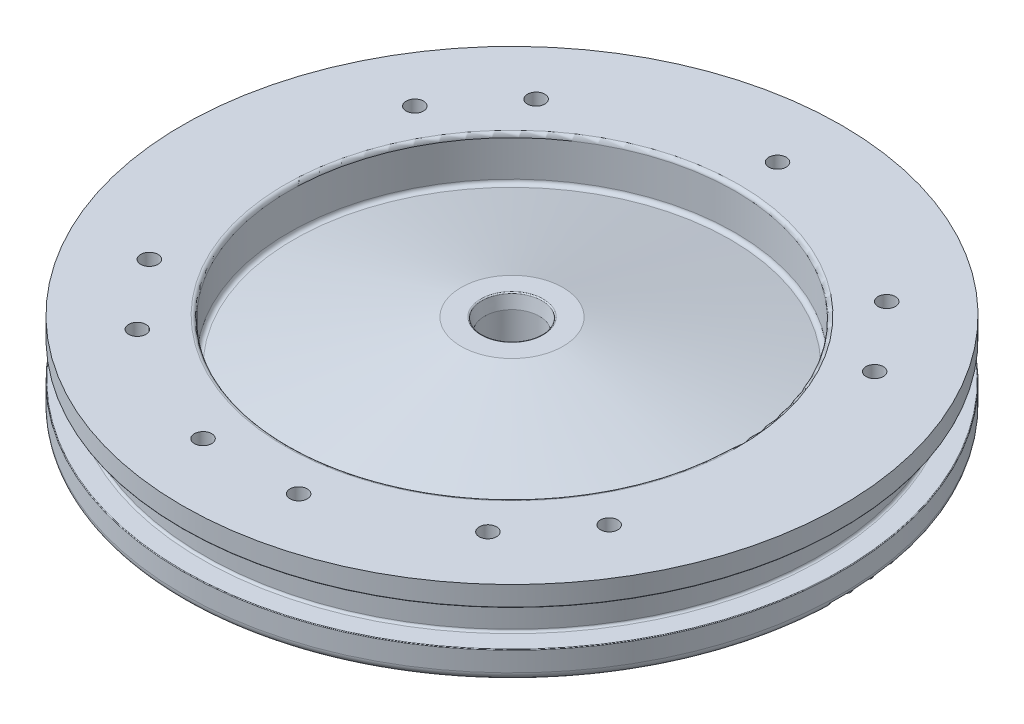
from build123d import *

# Parameters (mm, degrees)
FILLET6_R                 = 0.762
F_8_32_TAPPED_HOLE1_D     = 3.4544
F_8_32_TAPPED_HOLE1_DEPTH = 10.7188
CIRPATTERN1_COUNT         = 6
F_8_32_TAPPED_HOLE2_D     = 3.4544
F_8_32_TAPPED_HOLE2_DEPTH = 10.7188
F_8_32_TAPPED_HOLE2_TIP   = 1.037806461
F_8_32_TAPPED_HOLE3_D     = 3.4544
F_8_32_TAPPED_HOLE3_DEPTH = 10.7188
F_8_32_TAPPED_HOLE3_TIP   = 1.037806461


with BuildPart() as part:
    # Sketch1 → Revolve1 (revolve)
    with BuildSketch(Plane.XY, mode=Mode.PRIVATE) as revolve1_sk:
        with BuildLine():
            Line((-61.7855, -11.22045), (-65.532, -11.22045))
            ThreePointArc((-65.532, -11.22045), (-65.621802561, -11.257647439), (-65.659, -11.34745))
            Line((-65.659, -11.34745), (-65.659, -15.24))
            ThreePointArc((-65.659, -15.24), (-65.194032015, -16.362532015), (-64.0715, -16.8275))
            Line((-64.0715, -16.8275), (-59.309, -16.8275))
            Line((-59.309, -16.8275), (0, -8.89))
            Line((0, -8.89), (0, 0))
            Line((0, 0), (-65.659, 0))
            Line((-65.659, 0), (-65.659, -3.89255))
            ThreePointArc((-65.659, -3.89255), (-65.621802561, -3.982352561), (-65.532, -4.01955))
            Line((-65.532, -4.01955), (-61.7855, -4.01955))
            ThreePointArc((-61.7855, -4.01955), (-61.471191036, -4.149741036), (-61.341, -4.46405))
            Line((-61.341, -4.46405), (-61.341, -10.77595))
            ThreePointArc((-61.341, -10.77595), (-61.471191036, -11.090258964), (-61.7855, -11.22045))
        make_face()
    revolve(revolve1_sk.sketch.rotate(Axis((0, -8.89, 0), (0, 1, 0)), 270), axis=Axis((0, -8.89, 0), (0, 1, 0)))

    # Sketch18 → Cut-Revolve1 (revolve, cut)
    with BuildSketch(Plane.XY, mode=Mode.PRIVATE) as cut_revolve1_sk:
        Polygon((-10.16, 0), (-44.45, 0), (-44.45, -8.89), (-10.16, -0.254), align=None)
    revolve(cut_revolve1_sk.sketch.rotate(Axis((0, 0, 0), (0, -1, 0)), 270), axis=Axis((0, 0, 0), (0, -1, 0)), mode=Mode.SUBTRACT)

    # Fillet6
    fillet6_edges = [part.edges().sort_by_distance(p)[0] for p in [
        (0, -8.89, -44.45),
        (0, 0, -44.45),
    ]]
    fillet(fillet6_edges, radius=FILLET6_R)

    # Port Sketch → SAE Port (revolve, cut)
    with BuildSketch(Plane(origin=(1.90754352, 0, 0.003214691), x_dir=(-0.9999985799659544, 0, -0.0016852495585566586), z_dir=(-0.0016852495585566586, 0, 0.9999985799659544)), mode=Mode.PRIVATE) as sae_port_sk:
        with BuildLine():
            Line((1.907546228, 28.634641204), (6.868166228, 25.654))
            Line((6.868166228, 25.654), (6.868166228, 11.754))
            Line((6.868166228, 11.754), (7.463796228, 11.754))
            Line((7.463796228, 11.754), (7.463796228, 2.764417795))
            Line((7.463796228, 2.764417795), (7.374214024, 2.854))
            Line((7.374214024, 2.854), (7.884096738, 0.455190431))
            ThreePointArc((7.884096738, 0.455190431), (7.972698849, 0.310604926), (8.132546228, 0.254))
            Line((8.132546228, 0.254), (12.407546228, 0.254))
            Line((12.407546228, 0.254), (12.407546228, 0))
            Line((12.407546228, 0), (1.907546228, 0))
            Line((1.907546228, 0), (1.907546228, 28.634641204))
        make_face()
    revolve(sae_port_sk.sketch.rotate(Axis((0, 0, 0), (0, -1, 0)), 269.903442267), axis=Axis((0, 0, 0), (0, -1, 0)), mode=Mode.SUBTRACT)

    # 8-32 Tapped Hole1
    with Locations(Plane(origin=(0, 0, 0), x_dir=(1, 0, 0), z_dir=(0, 1, 0))):
        with Locations((0, 52.8955)):
            f_8_32_tapped_hole1 = Hole(F_8_32_TAPPED_HOLE1_D / 2, depth=F_8_32_TAPPED_HOLE1_DEPTH)

    # CirPattern1: 8-32 Tapped Hole1 ×6 about axis, 1 skipped
    cirpattern1_axis = Axis((0, 0, 0), (0, -1, 0))
    add([f_8_32_tapped_hole1.rotate(cirpattern1_axis, i * 360 / CIRPATTERN1_COUNT) for i in range(1, CIRPATTERN1_COUNT) if i not in (3,)], mode=Mode.SUBTRACT)

    # 8-32 Tapped Hole2
    with Locations(Plane(origin=(0, 0, 0), x_dir=(1, 0, 0), z_dir=(0, 1, 0))):
        with Locations((-9.525, -52.030839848), (9.525, -52.030839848)):
            Hole(F_8_32_TAPPED_HOLE2_D / 2, depth=F_8_32_TAPPED_HOLE2_DEPTH)
            with Locations((0, 0, -(F_8_32_TAPPED_HOLE2_DEPTH + F_8_32_TAPPED_HOLE2_TIP / 2))):  # 118° drill point
                Cone(0, F_8_32_TAPPED_HOLE2_D / 2, F_8_32_TAPPED_HOLE2_TIP, mode=Mode.SUBTRACT)

    # 8-32 Tapped Hole3
    with Locations(Plane(origin=(0, 0, 0), x_dir=(1, 0, 0), z_dir=(0, 1, 0))):
        with Locations((34.925, 39.726292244), (34.925, -39.726292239), (-34.925, 39.726292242), (-34.925, -39.726292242)):
            Hole(F_8_32_TAPPED_HOLE3_D / 2, depth=F_8_32_TAPPED_HOLE3_DEPTH)
            with Locations((0, 0, -(F_8_32_TAPPED_HOLE3_DEPTH + F_8_32_TAPPED_HOLE3_TIP / 2))):  # 118° drill point
                Cone(0, F_8_32_TAPPED_HOLE3_D / 2, F_8_32_TAPPED_HOLE3_TIP, mode=Mode.SUBTRACT)


solid = part.part
